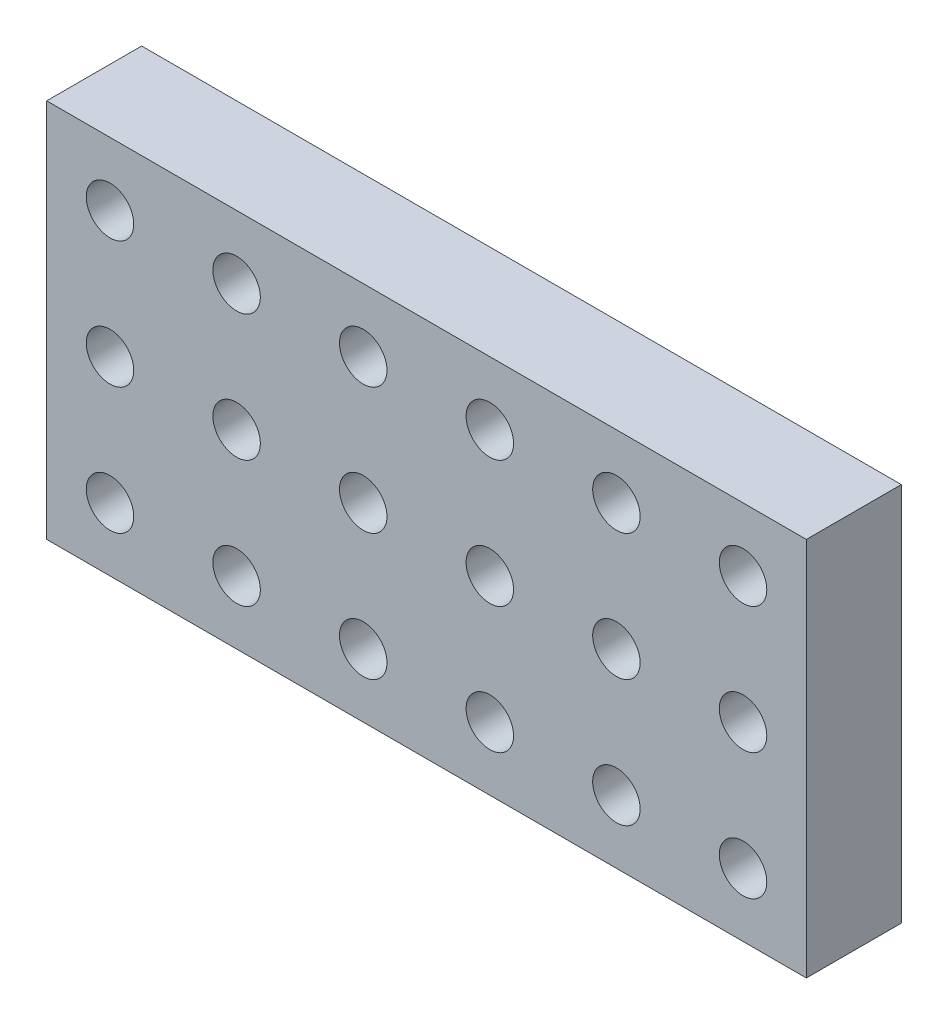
from build123d import *

# Parameters (mm, degrees)
SKETCH1_W          = 240
SKETCH1_H          = 120
EXTRUDE1_DEPTH     = 30
SKETCH2_R          = 7.5
CUT_EXTRUDE1_DEPTH = 30


with BuildPart() as part:
    # Sketch1 → Extrude1 (new body)
    with BuildSketch(Plane.XY):
        Rectangle(SKETCH1_W, SKETCH1_H)
    extrude(amount=EXTRUDE1_DEPTH)

    # Sketch2 → Cut-Extrude1 (cut)
    with BuildSketch(Plane.XY.offset(30)):
        with Locations((-100, 40)):
            Circle(SKETCH2_R)
        with Locations((-60, 40)):
            Circle(SKETCH2_R)
        with Locations((-20, 40)):
            Circle(SKETCH2_R)
        with Locations((20, 40)):
            Circle(SKETCH2_R)
        with Locations((60, 40)):
            Circle(SKETCH2_R)
        with Locations((100, 40)):
            Circle(SKETCH2_R)
        with Locations((-100, 0)):
            Circle(SKETCH2_R)
        with Locations((-60, 0)):
            Circle(SKETCH2_R)
        with Locations((-20, 0)):
            Circle(SKETCH2_R)
        with Locations((20, 0)):
            Circle(SKETCH2_R)
        with Locations((60, 0)):
            Circle(SKETCH2_R)
        with Locations((100, 0)):
            Circle(SKETCH2_R)
        with Locations((-100, -40)):
            Circle(SKETCH2_R)
        with Locations((-60, -40)):
            Circle(SKETCH2_R)
        with Locations((-20, -40)):
            Circle(SKETCH2_R)
        with Locations((20, -40)):
            Circle(SKETCH2_R)
        with Locations((60, -40)):
            Circle(SKETCH2_R)
        with Locations((100, -40)):
            Circle(SKETCH2_R)
    extrude(amount=-CUT_EXTRUDE1_DEPTH, mode=Mode.SUBTRACT)


solid = part.part
